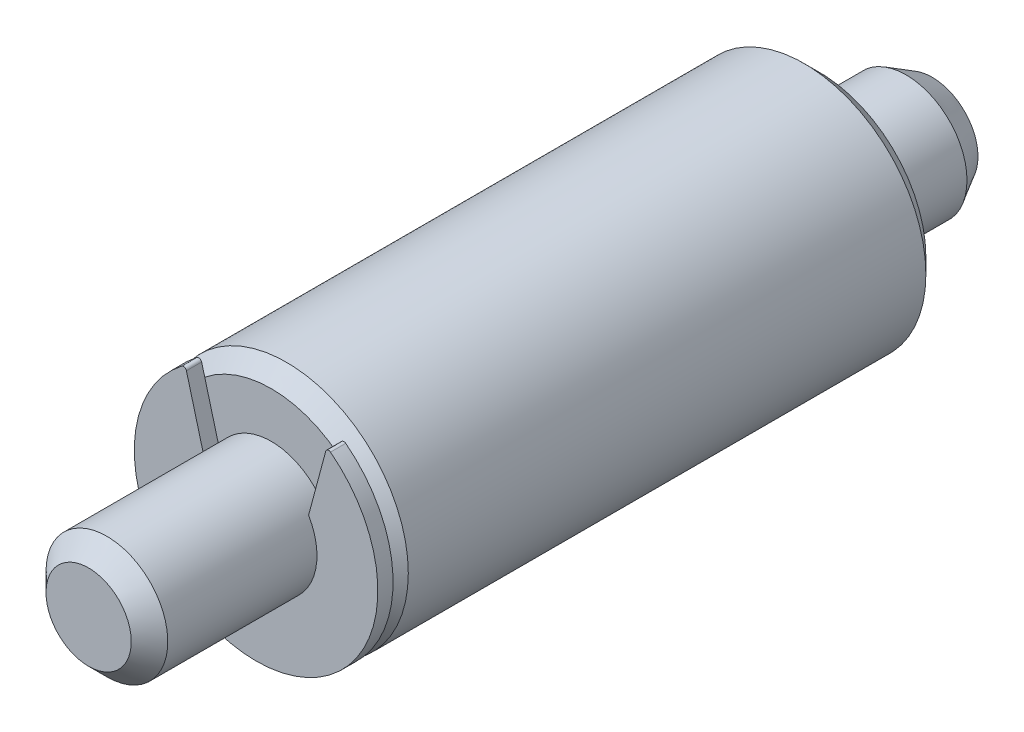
ISO-10303-21;
HEADER;
FILE_DESCRIPTION(('STEP AP214'),'2;1');
FILE_NAME('part.step','',(''),(''),'','','');
FILE_SCHEMA(('AUTOMOTIVE_DESIGN { 1 0 10303 214 1 1 1 1 }'));
ENDSEC;
DATA;
#1=APPLICATION_CONTEXT('core data for automotive mechanical design processes');
#2=APPLICATION_PROTOCOL_DEFINITION('international standard','automotive_design',2000,#1);
#3=PRODUCT_CONTEXT('',#1,'mechanical');
#4=PRODUCT('Part','Part','',(#3));
#5=PRODUCT_RELATED_PRODUCT_CATEGORY('part','',(#4));
#6=PRODUCT_DEFINITION_FORMATION('','',#4);
#7=PRODUCT_DEFINITION_CONTEXT('part definition',#1,'design');
#8=PRODUCT_DEFINITION('design','',#6,#7);
#9=PRODUCT_DEFINITION_SHAPE('','',#8);
#10=(LENGTH_UNIT() NAMED_UNIT(*) SI_UNIT(.MILLI.,.METRE.));
#11=(NAMED_UNIT(*) PLANE_ANGLE_UNIT() SI_UNIT($,.RADIAN.));
#12=(NAMED_UNIT(*) SI_UNIT($,.STERADIAN.) SOLID_ANGLE_UNIT());
#13=UNCERTAINTY_MEASURE_WITH_UNIT(LENGTH_MEASURE(1.E-05),#10,'distance_accuracy_value','');
#14=(GEOMETRIC_REPRESENTATION_CONTEXT(3) GLOBAL_UNCERTAINTY_ASSIGNED_CONTEXT((#13)) GLOBAL_UNIT_ASSIGNED_CONTEXT((#10,
#11,#12)) REPRESENTATION_CONTEXT('',''));
#15=CARTESIAN_POINT('',(0.,0.,0.));
#16=DIRECTION('',(0.,0.,1.));
#17=DIRECTION('',(1.,0.,0.));
#18=AXIS2_PLACEMENT_3D('',#15,#16,#17);
#19=CARTESIAN_POINT('',(7.084,-7.10837582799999,36.));
#20=DIRECTION('',(0.,0.,-1.));
#21=DIRECTION('',(-1.,0.,0.));
#22=AXIS2_PLACEMENT_3D('',#19,#20,#21);
#23=PLANE('',#22);
#24=DIRECTION('',(-0.258819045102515,-0.96592582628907,0.));
#25=VECTOR('',#24,1.);
#26=CARTESIAN_POINT('',(3.45,2.02422824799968,36.));
#27=LINE('',#26,#25);
#28=CARTESIAN_POINT('',(4.37235189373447,5.46649237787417,36.));
#29=VERTEX_POINT('',#28);
#30=CARTESIAN_POINT('',(3.45,2.02422824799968,36.));
#31=VERTEX_POINT('',#30);
#32=EDGE_CURVE('E156',#29,#31,#27,.T.);
#33=ORIENTED_EDGE('',*,*,#32,.F.);
#34=CARTESIAN_POINT('',(0.,0.,36.));
#35=DIRECTION('',(0.,0.,-1.));
#36=DIRECTION('',(0.,-1.,0.));
#37=AXIS2_PLACEMENT_3D('',#34,#35,#36);
#38=CIRCLE('',#37,7.);
#39=CARTESIAN_POINT('',(-4.37235189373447,5.46649237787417,36.));
#40=VERTEX_POINT('',#39);
#41=EDGE_CURVE('E159',#40,#29,#38,.T.);
#42=ORIENTED_EDGE('',*,*,#41,.F.);
#43=DIRECTION('',(-0.258819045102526,0.965925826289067,0.));
#44=VECTOR('',#43,1.);
#45=CARTESIAN_POINT('',(-3.45,2.02422824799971,36.));
#46=LINE('',#45,#44);
#47=CARTESIAN_POINT('',(-3.45,2.02422824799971,36.));
#48=VERTEX_POINT('',#47);
#49=EDGE_CURVE('E324',#48,#40,#46,.T.);
#50=ORIENTED_EDGE('',*,*,#49,.F.);
#51=CARTESIAN_POINT('',(0.,0.,36.));
#52=DIRECTION('',(0.,0.,-1.));
#53=DIRECTION('',(0.,-1.,0.));
#54=AXIS2_PLACEMENT_3D('',#51,#52,#53);
#55=CIRCLE('',#54,4.);
#56=EDGE_CURVE('E161',#31,#48,#55,.F.);
#57=ORIENTED_EDGE('',*,*,#56,.F.);
#58=EDGE_LOOP('',(#33,#42,#50,#57));
#59=FACE_BOUND('',#58,.T.);
#60=ADVANCED_FACE('F14',(#59),#23,.F.);
#61=CARTESIAN_POINT('',(0.,0.,46.8));
#62=DIRECTION('',(0.,0.,-1.));
#63=DIRECTION('',(0.,-1.,0.));
#64=AXIS2_PLACEMENT_3D('',#61,#62,#63);
#65=CYLINDRICAL_SURFACE('',#64,4.);
#66=CARTESIAN_POINT('',(0.,0.,46.8));
#67=DIRECTION('',(0.,0.,-1.));
#68=DIRECTION('',(-1.,0.,0.));
#69=AXIS2_PLACEMENT_3D('',#66,#67,#68);
#70=CIRCLE('',#69,4.);
#71=CARTESIAN_POINT('',(-4.,0.,46.8));
#72=VERTEX_POINT('',#71);
#73=EDGE_CURVE('E9',#72,#72,#70,.F.);
#74=ORIENTED_EDGE('',*,*,#73,.F.);
#75=EDGE_LOOP('',(#74));
#76=FACE_BOUND('',#75,.T.);
#77=DIRECTION('',(0.,0.,-1.));
#78=VECTOR('',#77,1.);
#79=CARTESIAN_POINT('',(3.45,2.02422824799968,37.));
#80=LINE('',#79,#78);
#81=CARTESIAN_POINT('',(3.45,2.0242282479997,37.));
#82=VERTEX_POINT('',#81);
#83=EDGE_CURVE('E31',#82,#31,#80,.T.);
#84=ORIENTED_EDGE('',*,*,#83,.T.);
#85=ORIENTED_EDGE('',*,*,#56,.T.);
#86=DIRECTION('',(0.,0.,-1.));
#87=VECTOR('',#86,1.);
#88=CARTESIAN_POINT('',(-3.45,2.02422824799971,37.));
#89=LINE('',#88,#87);
#90=CARTESIAN_POINT('',(-3.45,2.02422824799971,37.));
#91=VERTEX_POINT('',#90);
#92=EDGE_CURVE('E336',#91,#48,#89,.T.);
#93=ORIENTED_EDGE('',*,*,#92,.F.);
#94=CARTESIAN_POINT('',(0.,0.,37.));
#95=DIRECTION('',(0.,0.,-1.));
#96=DIRECTION('',(1.,0.,0.));
#97=AXIS2_PLACEMENT_3D('',#94,#95,#96);
#98=CIRCLE('',#97,4.);
#99=EDGE_CURVE('E340',#82,#91,#98,.T.);
#100=ORIENTED_EDGE('',*,*,#99,.F.);
#101=EDGE_LOOP('',(#84,#85,#93,#100));
#102=FACE_BOUND('',#101,.T.);
#103=ADVANCED_FACE('F114',(#76,#102),#65,.T.);
#104=CARTESIAN_POINT('',(-1.06965103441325E-10,-3.82097131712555E-10,4.89108753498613E-10));
#105=DIRECTION('',(-1.,0.,0.));
#106=DIRECTION('',(0.,0.,-1.));
#107=AXIS2_PLACEMENT_3D('',#104,#105,#106);
#108=SPHERICAL_SURFACE('',#107,8.);
#109=CARTESIAN_POINT('',(0.,0.,-7.41135340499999));
#110=DIRECTION('',(0.,0.,1.));
#111=DIRECTION('',(1.,0.,0.));
#112=AXIS2_PLACEMENT_3D('',#109,#110,#111);
#113=CIRCLE('',#112,3.011949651);
#114=CARTESIAN_POINT('',(3.011949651,0.,-7.41135340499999));
#115=VERTEX_POINT('',#114);
#116=EDGE_CURVE('E18',#115,#115,#113,.T.);
#117=ORIENTED_EDGE('',*,*,#116,.F.);
#118=EDGE_LOOP('',(#117));
#119=FACE_BOUND('',#118,.T.);
#120=ADVANCED_FACE('F109',(#119),#108,.T.);
#121=CARTESIAN_POINT('',(0.,0.,-7.41135340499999));
#122=DIRECTION('',(0.,0.,1.));
#123=DIRECTION('',(1.,0.,0.));
#124=AXIS2_PLACEMENT_3D('',#121,#122,#123);
#125=CONICAL_SURFACE('',#124,3.011949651,0.523598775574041);
#126=ORIENTED_EDGE('',*,*,#116,.T.);
#127=EDGE_LOOP('',(#126));
#128=FACE_BOUND('',#127,.T.);
#129=CARTESIAN_POINT('',(0.,0.,-5.7));
#130=DIRECTION('',(0.,0.,-1.));
#131=DIRECTION('',(-1.,0.,0.));
#132=AXIS2_PLACEMENT_3D('',#129,#130,#131);
#133=CIRCLE('',#132,4.);
#134=CARTESIAN_POINT('',(-4.,0.,-5.7));
#135=VERTEX_POINT('',#134);
#136=EDGE_CURVE('E177',#135,#135,#133,.F.);
#137=ORIENTED_EDGE('',*,*,#136,.F.);
#138=EDGE_LOOP('',(#137));
#139=FACE_BOUND('',#138,.T.);
#140=ADVANCED_FACE('F113',(#128,#139),#125,.T.);
#141=CARTESIAN_POINT('',(0.,0.,0.));
#142=DIRECTION('',(0.,0.,-1.));
#143=DIRECTION('',(-1.,0.,0.));
#144=AXIS2_PLACEMENT_3D('',#141,#142,#143);
#145=CYLINDRICAL_SURFACE('',#144,4.);
#146=CARTESIAN_POINT('',(0.,0.,0.));
#147=DIRECTION('',(0.,0.,-1.));
#148=DIRECTION('',(-1.,0.,0.));
#149=AXIS2_PLACEMENT_3D('',#146,#147,#148);
#150=CIRCLE('',#149,4.);
#151=CARTESIAN_POINT('',(-4.,0.,0.));
#152=VERTEX_POINT('',#151);
#153=EDGE_CURVE('E175',#152,#152,#150,.F.);
#154=ORIENTED_EDGE('',*,*,#153,.F.);
#155=EDGE_LOOP('',(#154));
#156=FACE_BOUND('',#155,.T.);
#157=ORIENTED_EDGE('',*,*,#136,.T.);
#158=EDGE_LOOP('',(#157));
#159=FACE_BOUND('',#158,.T.);
#160=ADVANCED_FACE('F120',(#156,#159),#145,.T.);
#161=CARTESIAN_POINT('',(7.084,-7.10837582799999,0.));
#162=DIRECTION('',(0.,0.,-1.));
#163=DIRECTION('',(-1.,0.,0.));
#164=AXIS2_PLACEMENT_3D('',#161,#162,#163);
#165=PLANE('',#164);
#166=ORIENTED_EDGE('',*,*,#153,.T.);
#167=EDGE_LOOP('',(#166));
#168=FACE_BOUND('',#167,.T.);
#169=CARTESIAN_POINT('',(0.,0.,0.));
#170=DIRECTION('',(0.,0.,1.));
#171=DIRECTION('',(1.,0.,0.));
#172=AXIS2_PLACEMENT_3D('',#169,#170,#171);
#173=CIRCLE('',#172,7.);
#174=CARTESIAN_POINT('',(7.,0.,0.));
#175=VERTEX_POINT('',#174);
#176=EDGE_CURVE('E173',#175,#175,#173,.T.);
#177=ORIENTED_EDGE('',*,*,#176,.F.);
#178=EDGE_LOOP('',(#177));
#179=FACE_BOUND('',#178,.T.);
#180=ADVANCED_FACE('F124',(#168,#179),#165,.T.);
#181=CARTESIAN_POINT('',(0.,0.,0.));
#182=DIRECTION('',(0.,0.,1.));
#183=DIRECTION('',(1.,0.,0.));
#184=AXIS2_PLACEMENT_3D('',#181,#182,#183);
#185=CONICAL_SURFACE('',#184,7.,0.785398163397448);
#186=CARTESIAN_POINT('',(0.,0.,1.));
#187=DIRECTION('',(0.,0.,-1.));
#188=DIRECTION('',(-1.,0.,0.));
#189=AXIS2_PLACEMENT_3D('',#186,#187,#188);
#190=CIRCLE('',#189,8.);
#191=CARTESIAN_POINT('',(-8.,0.,1.));
#192=VERTEX_POINT('',#191);
#193=EDGE_CURVE('E170',#192,#192,#190,.F.);
#194=ORIENTED_EDGE('',*,*,#193,.F.);
#195=EDGE_LOOP('',(#194));
#196=FACE_BOUND('',#195,.T.);
#197=ORIENTED_EDGE('',*,*,#176,.T.);
#198=EDGE_LOOP('',(#197));
#199=FACE_BOUND('',#198,.T.);
#200=ADVANCED_FACE('F126',(#196,#199),#185,.T.);
#201=CARTESIAN_POINT('',(0.,0.,35.));
#202=DIRECTION('',(0.,0.,-1.));
#203=DIRECTION('',(-1.,0.,0.));
#204=AXIS2_PLACEMENT_3D('',#201,#202,#203);
#205=CYLINDRICAL_SURFACE('',#204,8.);
#206=ORIENTED_EDGE('',*,*,#193,.T.);
#207=EDGE_LOOP('',(#206));
#208=FACE_BOUND('',#207,.T.);
#209=CARTESIAN_POINT('',(0.,0.,35.));
#210=DIRECTION('',(0.,0.,-1.));
#211=DIRECTION('',(-1.,0.,0.));
#212=AXIS2_PLACEMENT_3D('',#209,#210,#211);
#213=CIRCLE('',#212,8.);
#214=CARTESIAN_POINT('',(-8.,0.,35.));
#215=VERTEX_POINT('',#214);
#216=EDGE_CURVE('E166',#215,#215,#213,.F.);
#217=ORIENTED_EDGE('',*,*,#216,.F.);
#218=EDGE_LOOP('',(#217));
#219=FACE_BOUND('',#218,.T.);
#220=ADVANCED_FACE('F129',(#208,#219),#205,.T.);
#221=CARTESIAN_POINT('',(0.,0.,36.));
#222=DIRECTION('',(0.,0.,-1.));
#223=DIRECTION('',(0.,-1.,0.));
#224=AXIS2_PLACEMENT_3D('',#221,#222,#223);
#225=CONICAL_SURFACE('',#224,7.,0.785398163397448);
#226=ORIENTED_EDGE('',*,*,#216,.T.);
#227=EDGE_LOOP('',(#226));
#228=FACE_BOUND('',#227,.T.);
#229=ORIENTED_EDGE('',*,*,#41,.T.);
#230=CARTESIAN_POINT('',(0.,0.,36.));
#231=DIRECTION('',(0.,0.,1.));
#232=DIRECTION('',(1.,0.,0.));
#233=AXIS2_PLACEMENT_3D('',#230,#231,#232);
#234=CIRCLE('',#233,7.);
#235=EDGE_CURVE('E39',#40,#29,#234,.T.);
#236=ORIENTED_EDGE('',*,*,#235,.F.);
#237=EDGE_LOOP('',(#229,#236));
#238=FACE_BOUND('',#237,.T.);
#239=ADVANCED_FACE('F133',(#228,#238),#225,.T.);
#240=CARTESIAN_POINT('',(2.8336,-2.84335033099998,48.));
#241=DIRECTION('',(0.,0.,-1.));
#242=DIRECTION('',(-1.,0.,0.));
#243=AXIS2_PLACEMENT_3D('',#240,#241,#242);
#244=PLANE('',#243);
#245=CARTESIAN_POINT('',(0.,0.,48.));
#246=DIRECTION('',(0.,0.,-1.));
#247=DIRECTION('',(0.,-1.,0.));
#248=AXIS2_PLACEMENT_3D('',#245,#246,#247);
#249=CIRCLE('',#248,2.8);
#250=CARTESIAN_POINT('',(0.,-2.8,48.));
#251=VERTEX_POINT('',#250);
#252=EDGE_CURVE('E23',#251,#251,#249,.T.);
#253=ORIENTED_EDGE('',*,*,#252,.F.);
#254=EDGE_LOOP('',(#253));
#255=FACE_BOUND('',#254,.T.);
#256=ADVANCED_FACE('F16',(#255),#244,.F.);
#257=CARTESIAN_POINT('',(0.,0.,48.));
#258=DIRECTION('',(0.,0.,-1.));
#259=DIRECTION('',(0.,-1.,0.));
#260=AXIS2_PLACEMENT_3D('',#257,#258,#259);
#261=CONICAL_SURFACE('',#260,2.8,0.785398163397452);
#262=ORIENTED_EDGE('',*,*,#73,.T.);
#263=EDGE_LOOP('',(#262));
#264=FACE_BOUND('',#263,.T.);
#265=ORIENTED_EDGE('',*,*,#252,.T.);
#266=EDGE_LOOP('',(#265));
#267=FACE_BOUND('',#266,.T.);
#268=ADVANCED_FACE('F141',(#264,#267),#261,.T.);
#269=CARTESIAN_POINT('',(0.,0.,36.));
#270=DIRECTION('',(0.,0.,1.));
#271=DIRECTION('',(1.,0.,0.));
#272=AXIS2_PLACEMENT_3D('',#269,#270,#271);
#273=PLANE('',#272);
#274=CARTESIAN_POINT('',(-4.57541189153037,6.22432260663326,36.));
#275=VERTEX_POINT('',#274);
#276=EDGE_CURVE('E332',#40,#275,#46,.T.);
#277=ORIENTED_EDGE('',*,*,#276,.F.);
#278=ORIENTED_EDGE('',*,*,#235,.T.);
#279=CARTESIAN_POINT('',(4.57541189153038,6.22432260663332,36.));
#280=VERTEX_POINT('',#279);
#281=EDGE_CURVE('E162',#280,#29,#27,.T.);
#282=ORIENTED_EDGE('',*,*,#281,.F.);
#283=CARTESIAN_POINT('',(4.76859705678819,6.17255879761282,36.));
#284=DIRECTION('',(0.,0.,1.));
#285=DIRECTION('',(1.,0.,0.));
#286=AXIS2_PLACEMENT_3D('',#283,#284,#285);
#287=CIRCLE('',#286,0.200000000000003);
#288=CARTESIAN_POINT('',(4.89086877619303,6.33082953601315,36.));
#289=VERTEX_POINT('',#288);
#290=EDGE_CURVE('E163',#289,#280,#287,.T.);
#291=ORIENTED_EDGE('',*,*,#290,.F.);
#292=CARTESIAN_POINT('',(0.,0.,36.));
#293=DIRECTION('',(0.,0.,1.));
#294=DIRECTION('',(1.,0.,0.));
#295=AXIS2_PLACEMENT_3D('',#292,#293,#294);
#296=CIRCLE('',#295,7.99999999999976);
#297=CARTESIAN_POINT('',(-4.89086877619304,6.33082953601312,36.));
#298=VERTEX_POINT('',#297);
#299=EDGE_CURVE('E100',#298,#289,#296,.T.);
#300=ORIENTED_EDGE('',*,*,#299,.F.);
#301=CARTESIAN_POINT('',(-4.76859705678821,6.17255879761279,36.));
#302=DIRECTION('',(0.,0.,1.));
#303=DIRECTION('',(1.,0.,0.));
#304=AXIS2_PLACEMENT_3D('',#301,#302,#303);
#305=CIRCLE('',#304,0.200000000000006);
#306=EDGE_CURVE('E96',#275,#298,#305,.T.);
#307=ORIENTED_EDGE('',*,*,#306,.F.);
#308=EDGE_LOOP('',(#277,#278,#282,#291,#300,#307));
#309=FACE_BOUND('',#308,.T.);
#310=ADVANCED_FACE('F116',(#309),#273,.F.);
#311=CARTESIAN_POINT('',(0.,0.,37.));
#312=DIRECTION('',(0.,0.,-1.));
#313=DIRECTION('',(-1.,0.,0.));
#314=AXIS2_PLACEMENT_3D('',#311,#312,#313);
#315=CYLINDRICAL_SURFACE('',#314,7.99999999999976);
#316=ORIENTED_EDGE('',*,*,#299,.T.);
#317=DIRECTION('',(0.,0.,-1.));
#318=VECTOR('',#317,1.);
#319=CARTESIAN_POINT('',(4.89086877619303,6.33082953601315,37.));
#320=LINE('',#319,#318);
#321=CARTESIAN_POINT('',(4.89086877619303,6.33082953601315,37.));
#322=VERTEX_POINT('',#321);
#323=EDGE_CURVE('E81',#322,#289,#320,.T.);
#324=ORIENTED_EDGE('',*,*,#323,.F.);
#325=CARTESIAN_POINT('',(0.,0.,37.));
#326=DIRECTION('',(0.,0.,1.));
#327=DIRECTION('',(1.,0.,0.));
#328=AXIS2_PLACEMENT_3D('',#325,#326,#327);
#329=CIRCLE('',#328,7.99999999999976);
#330=CARTESIAN_POINT('',(-4.89086877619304,6.33082953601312,37.));
#331=VERTEX_POINT('',#330);
#332=EDGE_CURVE('E87',#331,#322,#329,.T.);
#333=ORIENTED_EDGE('',*,*,#332,.F.);
#334=DIRECTION('',(0.,0.,-1.));
#335=VECTOR('',#334,1.);
#336=CARTESIAN_POINT('',(-4.89086877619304,6.33082953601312,37.));
#337=LINE('',#336,#335);
#338=EDGE_CURVE('E321',#331,#298,#337,.T.);
#339=ORIENTED_EDGE('',*,*,#338,.T.);
#340=EDGE_LOOP('',(#316,#324,#333,#339));
#341=FACE_BOUND('',#340,.T.);
#342=ADVANCED_FACE('F98',(#341),#315,.T.);
#343=CARTESIAN_POINT('',(4.76859705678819,6.17255879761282,37.));
#344=DIRECTION('',(0.,0.,-1.));
#345=DIRECTION('',(-1.,0.,0.));
#346=AXIS2_PLACEMENT_3D('',#343,#344,#345);
#347=CYLINDRICAL_SURFACE('',#346,0.200000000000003);
#348=ORIENTED_EDGE('',*,*,#290,.T.);
#349=DIRECTION('',(0.,0.,-1.));
#350=VECTOR('',#349,1.);
#351=CARTESIAN_POINT('',(4.57541189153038,6.22432260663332,37.));
#352=LINE('',#351,#350);
#353=CARTESIAN_POINT('',(4.57541189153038,6.22432260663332,37.));
#354=VERTEX_POINT('',#353);
#355=EDGE_CURVE('E84',#354,#280,#352,.T.);
#356=ORIENTED_EDGE('',*,*,#355,.F.);
#357=CARTESIAN_POINT('',(4.76859705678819,6.17255879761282,37.));
#358=DIRECTION('',(0.,0.,1.));
#359=DIRECTION('',(1.,0.,0.));
#360=AXIS2_PLACEMENT_3D('',#357,#358,#359);
#361=CIRCLE('',#360,0.200000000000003);
#362=EDGE_CURVE('E77',#322,#354,#361,.T.);
#363=ORIENTED_EDGE('',*,*,#362,.F.);
#364=ORIENTED_EDGE('',*,*,#323,.T.);
#365=EDGE_LOOP('',(#348,#356,#363,#364));
#366=FACE_BOUND('',#365,.T.);
#367=ADVANCED_FACE('F79',(#366),#347,.T.);
#368=CARTESIAN_POINT('',(3.45,2.02422824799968,37.));
#369=DIRECTION('',(0.96592582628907,-0.258819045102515,0.));
#370=DIRECTION('',(0.258819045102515,0.96592582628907,0.));
#371=AXIS2_PLACEMENT_3D('',#368,#369,#370);
#372=PLANE('',#371);
#373=ORIENTED_EDGE('',*,*,#281,.T.);
#374=ORIENTED_EDGE('',*,*,#32,.T.);
#375=ORIENTED_EDGE('',*,*,#83,.F.);
#376=DIRECTION('',(-0.258819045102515,-0.96592582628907,0.));
#377=VECTOR('',#376,1.);
#378=CARTESIAN_POINT('',(3.45,2.02422824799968,37.));
#379=LINE('',#378,#377);
#380=EDGE_CURVE('E86',#354,#82,#379,.T.);
#381=ORIENTED_EDGE('',*,*,#380,.F.);
#382=ORIENTED_EDGE('',*,*,#355,.T.);
#383=EDGE_LOOP('',(#373,#374,#375,#381,#382));
#384=FACE_BOUND('',#383,.T.);
#385=ADVANCED_FACE('F226',(#384),#372,.F.);
#386=CARTESIAN_POINT('',(-3.45,2.02422824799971,37.));
#387=DIRECTION('',(-0.965925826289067,-0.258819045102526,0.));
#388=DIRECTION('',(0.258819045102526,-0.965925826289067,0.));
#389=AXIS2_PLACEMENT_3D('',#386,#387,#388);
#390=PLANE('',#389);
#391=ORIENTED_EDGE('',*,*,#49,.T.);
#392=ORIENTED_EDGE('',*,*,#276,.T.);
#393=DIRECTION('',(0.,0.,-1.));
#394=VECTOR('',#393,1.);
#395=CARTESIAN_POINT('',(-4.57541189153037,6.22432260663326,37.));
#396=LINE('',#395,#394);
#397=CARTESIAN_POINT('',(-4.57541189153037,6.22432260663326,37.));
#398=VERTEX_POINT('',#397);
#399=EDGE_CURVE('E323',#398,#275,#396,.T.);
#400=ORIENTED_EDGE('',*,*,#399,.F.);
#401=DIRECTION('',(-0.258819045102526,0.965925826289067,0.));
#402=VECTOR('',#401,1.);
#403=CARTESIAN_POINT('',(-3.45,2.02422824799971,37.));
#404=LINE('',#403,#402);
#405=EDGE_CURVE('E342',#91,#398,#404,.T.);
#406=ORIENTED_EDGE('',*,*,#405,.F.);
#407=ORIENTED_EDGE('',*,*,#92,.T.);
#408=EDGE_LOOP('',(#391,#392,#400,#406,#407));
#409=FACE_BOUND('',#408,.T.);
#410=ADVANCED_FACE('F233',(#409),#390,.F.);
#411=CARTESIAN_POINT('',(-4.76859705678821,6.17255879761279,37.));
#412=DIRECTION('',(0.,0.,-1.));
#413=DIRECTION('',(-1.,0.,0.));
#414=AXIS2_PLACEMENT_3D('',#411,#412,#413);
#415=CYLINDRICAL_SURFACE('',#414,0.200000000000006);
#416=ORIENTED_EDGE('',*,*,#306,.T.);
#417=ORIENTED_EDGE('',*,*,#338,.F.);
#418=CARTESIAN_POINT('',(-4.76859705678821,6.17255879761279,37.));
#419=DIRECTION('',(0.,0.,1.));
#420=DIRECTION('',(1.,0.,0.));
#421=AXIS2_PLACEMENT_3D('',#418,#419,#420);
#422=CIRCLE('',#421,0.200000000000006);
#423=EDGE_CURVE('E92',#398,#331,#422,.T.);
#424=ORIENTED_EDGE('',*,*,#423,.F.);
#425=ORIENTED_EDGE('',*,*,#399,.T.);
#426=EDGE_LOOP('',(#416,#417,#424,#425));
#427=FACE_BOUND('',#426,.T.);
#428=ADVANCED_FACE('F241',(#427),#415,.T.);
#429=CARTESIAN_POINT('',(0.,0.,37.));
#430=DIRECTION('',(0.,0.,1.));
#431=DIRECTION('',(1.,0.,0.));
#432=AXIS2_PLACEMENT_3D('',#429,#430,#431);
#433=PLANE('',#432);
#434=ORIENTED_EDGE('',*,*,#332,.T.);
#435=ORIENTED_EDGE('',*,*,#362,.T.);
#436=ORIENTED_EDGE('',*,*,#380,.T.);
#437=ORIENTED_EDGE('',*,*,#99,.T.);
#438=ORIENTED_EDGE('',*,*,#405,.T.);
#439=ORIENTED_EDGE('',*,*,#423,.T.);
#440=EDGE_LOOP('',(#434,#435,#436,#437,#438,#439));
#441=FACE_BOUND('',#440,.T.);
#442=ADVANCED_FACE('F90',(#441),#433,.T.);
#443=CLOSED_SHELL('',(#60,#103,#120,#140,#160,#180,#200,#220,#239,#256,#268,#310,#342,#367,#385,
#410,#428,#442));
#444=MANIFOLD_SOLID_BREP('B1',#443);
#445=ADVANCED_BREP_SHAPE_REPRESENTATION('',(#18,#444),#14);
#446=SHAPE_DEFINITION_REPRESENTATION(#9,#445);
ENDSEC;
END-ISO-10303-21;
